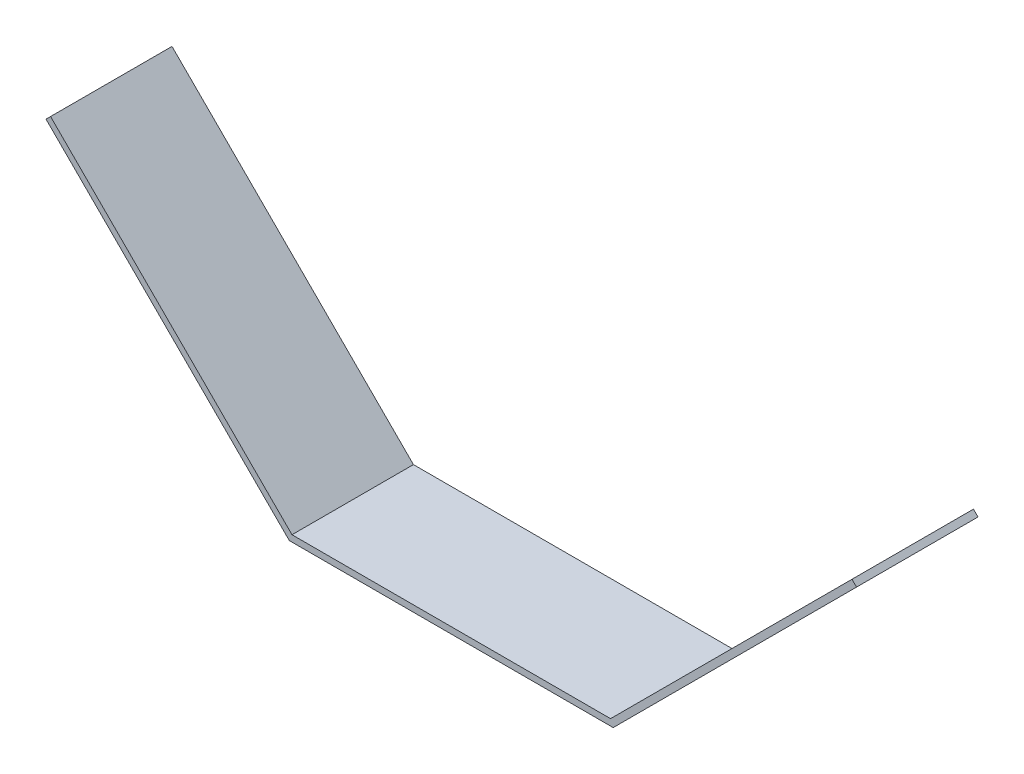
from build123d import *

# Parameters (mm, degrees)
BOSS_EXTRUDE1_DEPTH = 60


with BuildPart() as part:
    # Sketch1 → Boss-Extrude1 (new body)
    with BuildSketch(Plane.XY):
        Polygon((-80, 0), (80, 0), (200.208152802, 120.208152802), (197.963088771, 122.453216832), (78.684871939, 3.175), (-78.684871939, 3.175), (-197.963088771, 122.453216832), (-200.208152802, 120.208152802), align=None)
    extrude(amount=BOSS_EXTRUDE1_DEPTH)


solid = part.part
